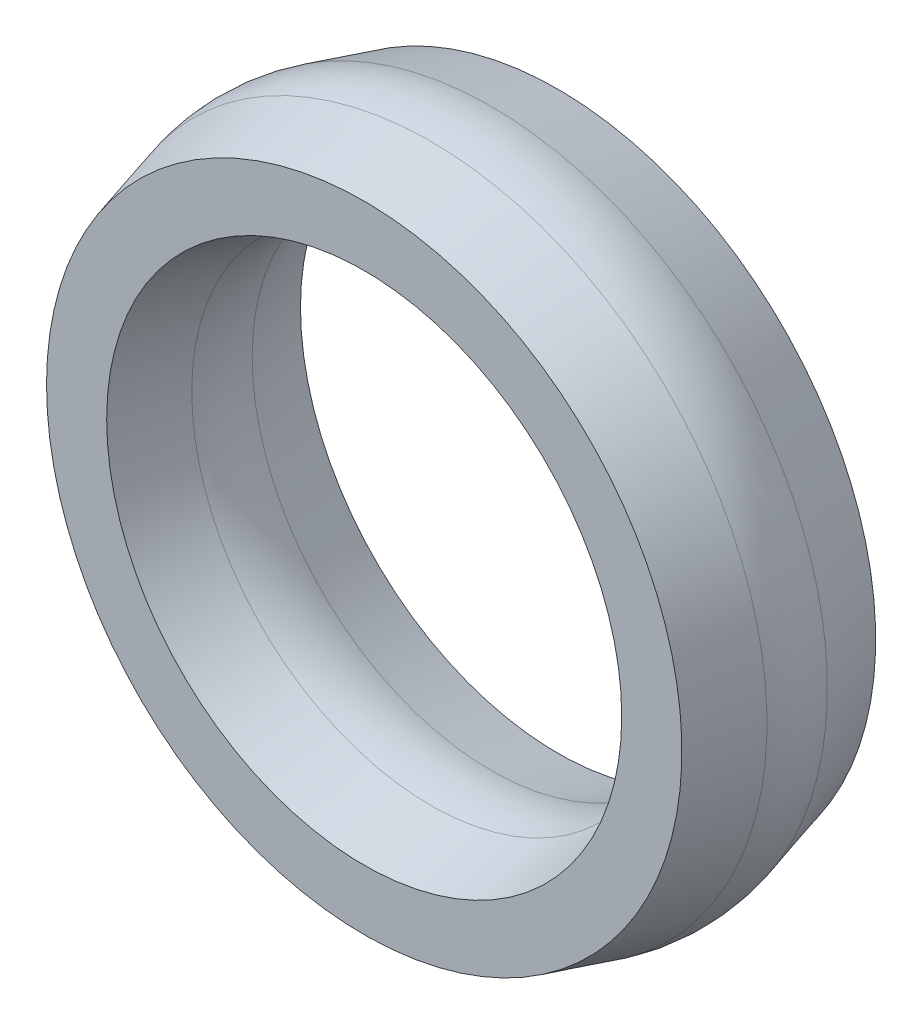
ISO-10303-21;
HEADER;
FILE_DESCRIPTION(('STEP AP214'),'2;1');
FILE_NAME('part.step','',(''),(''),'','','');
FILE_SCHEMA(('AUTOMOTIVE_DESIGN { 1 0 10303 214 1 1 1 1 }'));
ENDSEC;
DATA;
#1=APPLICATION_CONTEXT('core data for automotive mechanical design processes');
#2=APPLICATION_PROTOCOL_DEFINITION('international standard','automotive_design',2000,#1);
#3=PRODUCT_CONTEXT('',#1,'mechanical');
#4=PRODUCT('Part','Part','',(#3));
#5=PRODUCT_RELATED_PRODUCT_CATEGORY('part','',(#4));
#6=PRODUCT_DEFINITION_FORMATION('','',#4);
#7=PRODUCT_DEFINITION_CONTEXT('part definition',#1,'design');
#8=PRODUCT_DEFINITION('design','',#6,#7);
#9=PRODUCT_DEFINITION_SHAPE('','',#8);
#10=(LENGTH_UNIT() NAMED_UNIT(*) SI_UNIT(.MILLI.,.METRE.));
#11=(NAMED_UNIT(*) PLANE_ANGLE_UNIT() SI_UNIT($,.RADIAN.));
#12=(NAMED_UNIT(*) SI_UNIT($,.STERADIAN.) SOLID_ANGLE_UNIT());
#13=UNCERTAINTY_MEASURE_WITH_UNIT(LENGTH_MEASURE(1.E-05),#10,'distance_accuracy_value','');
#14=(GEOMETRIC_REPRESENTATION_CONTEXT(3) GLOBAL_UNCERTAINTY_ASSIGNED_CONTEXT((#13)) GLOBAL_UNIT_ASSIGNED_CONTEXT((#10,
#11,#12)) REPRESENTATION_CONTEXT('',''));
#15=CARTESIAN_POINT('',(0.,0.,0.));
#16=DIRECTION('',(0.,0.,1.));
#17=DIRECTION('',(1.,0.,0.));
#18=AXIS2_PLACEMENT_3D('',#15,#16,#17);
#19=CARTESIAN_POINT('',(0.,0.,-4.98960351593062));
#20=DIRECTION('',(0.,0.,1.));
#21=DIRECTION('',(1.,0.,0.));
#22=AXIS2_PLACEMENT_3D('',#19,#20,#21);
#23=CONICAL_SURFACE('',#22,17.8910525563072,0.269167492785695);
#24=CARTESIAN_POINT('',(0.,0.,0.));
#25=DIRECTION('',(0.,0.,-1.));
#26=DIRECTION('',(-1.,0.,0.));
#27=AXIS2_PLACEMENT_3D('',#24,#25,#26);
#28=CIRCLE('',#27,19.2674949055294);
#29=CARTESIAN_POINT('',(-19.2674949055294,0.,0.));
#30=VERTEX_POINT('',#29);
#31=EDGE_CURVE('E10',#30,#30,#28,.T.);
#32=ORIENTED_EDGE('',*,*,#31,.F.);
#33=EDGE_LOOP('',(#32));
#34=FACE_BOUND('',#33,.T.);
#35=CARTESIAN_POINT('',(0.,0.,-4.98960351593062));
#36=DIRECTION('',(0.,0.,-1.));
#37=DIRECTION('',(-1.,0.,0.));
#38=AXIS2_PLACEMENT_3D('',#35,#36,#37);
#39=CIRCLE('',#38,17.8910525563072);
#40=CARTESIAN_POINT('',(-17.8910525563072,0.,-4.98960351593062));
#41=VERTEX_POINT('',#40);
#42=EDGE_CURVE('E59',#41,#41,#39,.T.);
#43=ORIENTED_EDGE('',*,*,#42,.T.);
#44=EDGE_LOOP('',(#43));
#45=FACE_BOUND('',#44,.T.);
#46=ADVANCED_FACE('F31',(#34,#45),#23,.F.);
#47=CARTESIAN_POINT('',(23.7674949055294,0.,0.));
#48=DIRECTION('',(0.,0.,-1.));
#49=DIRECTION('',(-1.,0.,0.));
#50=AXIS2_PLACEMENT_3D('',#47,#48,#49);
#51=PLANE('',#50);
#52=CARTESIAN_POINT('',(0.,0.,0.));
#53=DIRECTION('',(0.,0.,-1.));
#54=DIRECTION('',(-1.,0.,0.));
#55=AXIS2_PLACEMENT_3D('',#52,#53,#54);
#56=CIRCLE('',#55,23.7674949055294);
#57=CARTESIAN_POINT('',(-23.7674949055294,0.,0.));
#58=VERTEX_POINT('',#57);
#59=EDGE_CURVE('E37',#58,#58,#56,.T.);
#60=ORIENTED_EDGE('',*,*,#59,.F.);
#61=EDGE_LOOP('',(#60));
#62=FACE_BOUND('',#61,.T.);
#63=ORIENTED_EDGE('',*,*,#31,.T.);
#64=EDGE_LOOP('',(#63));
#65=FACE_BOUND('',#64,.T.);
#66=ADVANCED_FACE('F96',(#62,#65),#51,.F.);
#67=CARTESIAN_POINT('',(0.,0.,0.));
#68=DIRECTION('',(0.,0.,-1.));
#69=DIRECTION('',(-1.,0.,0.));
#70=AXIS2_PLACEMENT_3D('',#67,#68,#69);
#71=CONICAL_SURFACE('',#70,23.7674949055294,0.269167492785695);
#72=CARTESIAN_POINT('',(0.,0.,-4.98960351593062));
#73=DIRECTION('',(0.,0.,-1.));
#74=DIRECTION('',(-1.,0.,0.));
#75=AXIS2_PLACEMENT_3D('',#72,#73,#74);
#76=CIRCLE('',#75,25.1439372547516);
#77=CARTESIAN_POINT('',(-25.1439372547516,0.,-4.98960351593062));
#78=VERTEX_POINT('',#77);
#79=EDGE_CURVE('E41',#78,#78,#76,.T.);
#80=ORIENTED_EDGE('',*,*,#79,.F.);
#81=EDGE_LOOP('',(#80));
#82=FACE_BOUND('',#81,.T.);
#83=ORIENTED_EDGE('',*,*,#59,.T.);
#84=EDGE_LOOP('',(#83));
#85=FACE_BOUND('',#84,.T.);
#86=ADVANCED_FACE('F91',(#82,#85),#71,.T.);
#87=CARTESIAN_POINT('',(0.,0.,-7.24999999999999));
#88=DIRECTION('',(0.,0.,-1.));
#89=DIRECTION('',(-1.,0.,0.));
#90=AXIS2_PLACEMENT_3D('',#87,#88,#89);
#91=TOROIDAL_SURFACE('',#90,16.95,8.5);
#92=CARTESIAN_POINT('',(0.,0.,-9.51039648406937));
#93=DIRECTION('',(0.,0.,-1.));
#94=DIRECTION('',(-1.,0.,0.));
#95=AXIS2_PLACEMENT_3D('',#92,#93,#94);
#96=CIRCLE('',#95,25.1439372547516);
#97=CARTESIAN_POINT('',(-25.1439372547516,0.,-9.51039648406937));
#98=VERTEX_POINT('',#97);
#99=EDGE_CURVE('E45',#98,#98,#96,.T.);
#100=ORIENTED_EDGE('',*,*,#99,.F.);
#101=EDGE_LOOP('',(#100));
#102=FACE_BOUND('',#101,.T.);
#103=ORIENTED_EDGE('',*,*,#79,.T.);
#104=EDGE_LOOP('',(#103));
#105=FACE_BOUND('',#104,.T.);
#106=ADVANCED_FACE('F85',(#102,#105),#91,.T.);
#107=CARTESIAN_POINT('',(0.,0.,-9.51039648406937));
#108=DIRECTION('',(0.,0.,1.));
#109=DIRECTION('',(1.,0.,0.));
#110=AXIS2_PLACEMENT_3D('',#107,#108,#109);
#111=CONICAL_SURFACE('',#110,25.1439372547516,0.269167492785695);
#112=CARTESIAN_POINT('',(0.,0.,-14.5));
#113=DIRECTION('',(0.,0.,-1.));
#114=DIRECTION('',(-1.,0.,0.));
#115=AXIS2_PLACEMENT_3D('',#112,#113,#114);
#116=CIRCLE('',#115,23.7674949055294);
#117=CARTESIAN_POINT('',(-23.7674949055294,0.,-14.5));
#118=VERTEX_POINT('',#117);
#119=EDGE_CURVE('E50',#118,#118,#116,.T.);
#120=ORIENTED_EDGE('',*,*,#119,.F.);
#121=EDGE_LOOP('',(#120));
#122=FACE_BOUND('',#121,.T.);
#123=ORIENTED_EDGE('',*,*,#99,.T.);
#124=EDGE_LOOP('',(#123));
#125=FACE_BOUND('',#124,.T.);
#126=ADVANCED_FACE('F79',(#122,#125),#111,.T.);
#127=CARTESIAN_POINT('',(23.7674949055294,0.,-14.5));
#128=DIRECTION('',(0.,0.,1.));
#129=DIRECTION('',(1.,0.,0.));
#130=AXIS2_PLACEMENT_3D('',#127,#128,#129);
#131=PLANE('',#130);
#132=CARTESIAN_POINT('',(0.,0.,-14.5));
#133=DIRECTION('',(0.,0.,-1.));
#134=DIRECTION('',(-1.,0.,0.));
#135=AXIS2_PLACEMENT_3D('',#132,#133,#134);
#136=CIRCLE('',#135,19.2674949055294);
#137=CARTESIAN_POINT('',(-19.2674949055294,0.,-14.5));
#138=VERTEX_POINT('',#137);
#139=EDGE_CURVE('E53',#138,#138,#136,.T.);
#140=ORIENTED_EDGE('',*,*,#139,.F.);
#141=EDGE_LOOP('',(#140));
#142=FACE_BOUND('',#141,.T.);
#143=ORIENTED_EDGE('',*,*,#119,.T.);
#144=EDGE_LOOP('',(#143));
#145=FACE_BOUND('',#144,.T.);
#146=ADVANCED_FACE('F73',(#142,#145),#131,.F.);
#147=CARTESIAN_POINT('',(0.,0.,-14.5));
#148=DIRECTION('',(0.,0.,-1.));
#149=DIRECTION('',(-1.,0.,0.));
#150=AXIS2_PLACEMENT_3D('',#147,#148,#149);
#151=CONICAL_SURFACE('',#150,19.2674949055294,0.269167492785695);
#152=CARTESIAN_POINT('',(0.,0.,-9.51039648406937));
#153=DIRECTION('',(0.,0.,-1.));
#154=DIRECTION('',(-1.,0.,0.));
#155=AXIS2_PLACEMENT_3D('',#152,#153,#154);
#156=CIRCLE('',#155,17.8910525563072);
#157=CARTESIAN_POINT('',(-17.8910525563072,0.,-9.51039648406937));
#158=VERTEX_POINT('',#157);
#159=EDGE_CURVE('E56',#158,#158,#156,.T.);
#160=ORIENTED_EDGE('',*,*,#159,.F.);
#161=EDGE_LOOP('',(#160));
#162=FACE_BOUND('',#161,.T.);
#163=ORIENTED_EDGE('',*,*,#139,.T.);
#164=EDGE_LOOP('',(#163));
#165=FACE_BOUND('',#164,.T.);
#166=ADVANCED_FACE('F67',(#162,#165),#151,.F.);
#167=CARTESIAN_POINT('',(0.,0.,-7.24999999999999));
#168=DIRECTION('',(0.,0.,-1.));
#169=DIRECTION('',(-1.,0.,0.));
#170=AXIS2_PLACEMENT_3D('',#167,#168,#169);
#171=TOROIDAL_SURFACE('',#170,26.0849898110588,8.5);
#172=ORIENTED_EDGE('',*,*,#42,.F.);
#173=EDGE_LOOP('',(#172));
#174=FACE_BOUND('',#173,.T.);
#175=ORIENTED_EDGE('',*,*,#159,.T.);
#176=EDGE_LOOP('',(#175));
#177=FACE_BOUND('',#176,.T.);
#178=ADVANCED_FACE('F64',(#174,#177),#171,.T.);
#179=CLOSED_SHELL('',(#46,#66,#86,#106,#126,#146,#166,#178));
#180=MANIFOLD_SOLID_BREP('B2',#179);
#181=ADVANCED_BREP_SHAPE_REPRESENTATION('',(#18,#180),#14);
#182=SHAPE_DEFINITION_REPRESENTATION(#9,#181);
ENDSEC;
END-ISO-10303-21;
